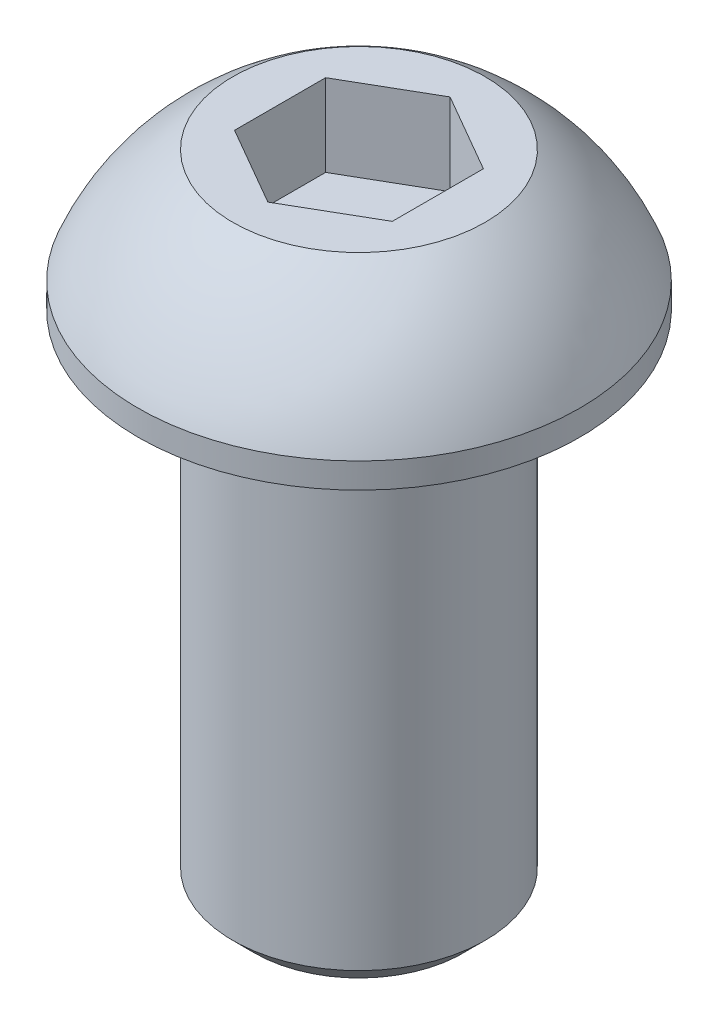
ISO-10303-21;
HEADER;
FILE_DESCRIPTION(('STEP AP214'),'2;1');
FILE_NAME('part.step','',(''),(''),'','','');
FILE_SCHEMA(('AUTOMOTIVE_DESIGN { 1 0 10303 214 1 1 1 1 }'));
ENDSEC;
DATA;
#1=APPLICATION_CONTEXT('core data for automotive mechanical design processes');
#2=APPLICATION_PROTOCOL_DEFINITION('international standard','automotive_design',2000,#1);
#3=PRODUCT_CONTEXT('',#1,'mechanical');
#4=PRODUCT('Part','Part','',(#3));
#5=PRODUCT_RELATED_PRODUCT_CATEGORY('part','',(#4));
#6=PRODUCT_DEFINITION_FORMATION('','',#4);
#7=PRODUCT_DEFINITION_CONTEXT('part definition',#1,'design');
#8=PRODUCT_DEFINITION('design','',#6,#7);
#9=PRODUCT_DEFINITION_SHAPE('','',#8);
#10=(LENGTH_UNIT() NAMED_UNIT(*) SI_UNIT(.MILLI.,.METRE.));
#11=(NAMED_UNIT(*) PLANE_ANGLE_UNIT() SI_UNIT($,.RADIAN.));
#12=(NAMED_UNIT(*) SI_UNIT($,.STERADIAN.) SOLID_ANGLE_UNIT());
#13=UNCERTAINTY_MEASURE_WITH_UNIT(LENGTH_MEASURE(1.E-05),#10,'distance_accuracy_value','');
#14=(GEOMETRIC_REPRESENTATION_CONTEXT(3) GLOBAL_UNCERTAINTY_ASSIGNED_CONTEXT((#13)) GLOBAL_UNIT_ASSIGNED_CONTEXT((#10,
#11,#12)) REPRESENTATION_CONTEXT('',''));
#15=CARTESIAN_POINT('',(0.,0.,0.));
#16=DIRECTION('',(0.,0.,1.));
#17=DIRECTION('',(1.,0.,0.));
#18=AXIS2_PLACEMENT_3D('',#15,#16,#17);
#19=CARTESIAN_POINT('',(0.,0.,0.));
#20=DIRECTION('',(0.,-1.,0.));
#21=DIRECTION('',(0.,0.,-1.));
#22=AXIS2_PLACEMENT_3D('',#19,#20,#21);
#23=PLANE('',#22);
#24=CARTESIAN_POINT('',(0.,0.,0.));
#25=DIRECTION('',(0.,-1.,0.));
#26=DIRECTION('',(0.,0.,-1.));
#27=AXIS2_PLACEMENT_3D('',#24,#25,#26);
#28=CIRCLE('',#27,4.);
#29=CARTESIAN_POINT('',(0.,0.,-4.));
#30=VERTEX_POINT('',#29);
#31=EDGE_CURVE('E131',#30,#30,#28,.T.);
#32=ORIENTED_EDGE('',*,*,#31,.F.);
#33=EDGE_LOOP('',(#32));
#34=FACE_BOUND('',#33,.T.);
#35=CARTESIAN_POINT('',(0.,0.,0.));
#36=DIRECTION('',(0.,-1.,0.));
#37=DIRECTION('',(0.,0.,-1.));
#38=AXIS2_PLACEMENT_3D('',#35,#36,#37);
#39=CIRCLE('',#38,7.);
#40=CARTESIAN_POINT('',(0.,0.,-7.));
#41=VERTEX_POINT('',#40);
#42=EDGE_CURVE('E11',#41,#41,#39,.T.);
#43=ORIENTED_EDGE('',*,*,#42,.T.);
#44=EDGE_LOOP('',(#43));
#45=FACE_BOUND('',#44,.T.);
#46=ADVANCED_FACE('F29',(#34,#45),#23,.T.);
#47=CARTESIAN_POINT('',(0.,0.,0.));
#48=DIRECTION('',(0.,-1.,0.));
#49=DIRECTION('',(0.,0.,-1.));
#50=AXIS2_PLACEMENT_3D('',#47,#48,#49);
#51=CYLINDRICAL_SURFACE('',#50,7.);
#52=CARTESIAN_POINT('',(0.,0.8,0.));
#53=DIRECTION('',(0.,-1.,0.));
#54=DIRECTION('',(0.,0.,-1.));
#55=AXIS2_PLACEMENT_3D('',#52,#53,#54);
#56=CIRCLE('',#55,7.);
#57=CARTESIAN_POINT('',(7.,0.8,0.));
#58=VERTEX_POINT('',#57);
#59=EDGE_CURVE('E36',#58,#58,#56,.T.);
#60=ORIENTED_EDGE('',*,*,#59,.T.);
#61=EDGE_LOOP('',(#60));
#62=FACE_BOUND('',#61,.T.);
#63=ORIENTED_EDGE('',*,*,#42,.F.);
#64=EDGE_LOOP('',(#63));
#65=FACE_BOUND('',#64,.T.);
#66=ADVANCED_FACE('F151',(#62,#65),#51,.T.);
#67=CARTESIAN_POINT('',(0.,-1.98333333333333,0.));
#68=DIRECTION('',(0.,-1.,0.));
#69=DIRECTION('',(1.,0.,0.));
#70=AXIS2_PLACEMENT_3D('',#67,#68,#69);
#71=SPHERICAL_SURFACE('',#70,7.53305677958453);
#72=CARTESIAN_POINT('',(0.,4.4,0.));
#73=DIRECTION('',(0.,-1.,0.));
#74=DIRECTION('',(0.,0.,-1.));
#75=AXIS2_PLACEMENT_3D('',#72,#73,#74);
#76=CIRCLE('',#75,4.);
#77=CARTESIAN_POINT('',(4.,4.4,0.));
#78=VERTEX_POINT('',#77);
#79=EDGE_CURVE('E146',#78,#78,#76,.T.);
#80=CARTESIAN_POINT('',(4.,4.4,0.));
#81=CARTESIAN_POINT('',(4.04206169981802,4.37364288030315,0.));
#82=CARTESIAN_POINT('',(4.08386281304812,4.34686991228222,0.));
#83=CARTESIAN_POINT('',(4.16692769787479,4.2925029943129,0.));
#84=CARTESIAN_POINT('',(4.20819146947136,4.26490904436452,0.));
#85=CARTESIAN_POINT('',(4.29016550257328,4.20891087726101,0.));
#86=CARTESIAN_POINT('',(4.33087576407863,4.18050666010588,0.));
#87=CARTESIAN_POINT('',(4.41172688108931,4.1228990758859,0.));
#88=CARTESIAN_POINT('',(4.45186773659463,4.09369570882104,0.));
#89=CARTESIAN_POINT('',(4.53156435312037,4.03450123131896,0.));
#90=CARTESIAN_POINT('',(4.57112011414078,4.00451012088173,0.));
#91=CARTESIAN_POINT('',(4.64963108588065,3.94375187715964,0.));
#92=CARTESIAN_POINT('',(4.6885862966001,3.91298474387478,0.));
#93=CARTESIAN_POINT('',(4.76588094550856,3.85068647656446,0.));
#94=CARTESIAN_POINT('',(4.80422038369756,3.819155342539,0.));
#95=CARTESIAN_POINT('',(4.88026850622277,3.75534139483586,0.));
#96=CARTESIAN_POINT('',(4.91797719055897,3.72305858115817,0.));
#97=CARTESIAN_POINT('',(4.99274907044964,3.65775388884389,0.));
#98=CARTESIAN_POINT('',(5.02981226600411,3.6247320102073,0.));
#99=CARTESIAN_POINT('',(5.10327868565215,3.55796209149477,0.));
#100=CARTESIAN_POINT('',(5.13968190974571,3.52421405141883,0.));
#101=CARTESIAN_POINT('',(5.21181416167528,3.45600499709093,0.));
#102=CARTESIAN_POINT('',(5.24754318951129,3.42154398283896,0.));
#103=CARTESIAN_POINT('',(5.31831308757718,3.35192244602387,0.));
#104=CARTESIAN_POINT('',(5.35335395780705,3.31676192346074,0.));
#105=CARTESIAN_POINT('',(5.4227338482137,3.24575510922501,0.));
#106=CARTESIAN_POINT('',(5.45707286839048,3.20990881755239,0.));
#107=CARTESIAN_POINT('',(5.52503564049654,3.13754447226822,0.));
#108=CARTESIAN_POINT('',(5.55865939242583,3.10102641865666,0.));
#109=CARTESIAN_POINT('',(5.62517848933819,3.02733281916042,0.));
#110=CARTESIAN_POINT('',(5.65807383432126,2.99015727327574,0.));
#111=CARTESIAN_POINT('',(5.7231232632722,2.91516321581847,0.));
#112=CARTESIAN_POINT('',(5.75527734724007,2.87734470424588,0.));
#113=CARTESIAN_POINT('',(5.81883168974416,2.80107949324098,0.));
#114=CARTESIAN_POINT('',(5.85023194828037,2.76263279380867,0.));
#115=CARTESIAN_POINT('',(5.91226637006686,2.68512623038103,0.));
#116=CARTESIAN_POINT('',(5.94290053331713,2.64606636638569,0.));
#117=CARTESIAN_POINT('',(6.00339079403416,2.56734873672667,0.));
#118=CARTESIAN_POINT('',(6.0332468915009,2.52769097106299,0.));
#119=CARTESIAN_POINT('',(6.09216935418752,2.44779303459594,0.));
#120=CARTESIAN_POINT('',(6.12123571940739,2.40755286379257,0.));
#121=CARTESIAN_POINT('',(6.17856735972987,2.32650584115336,0.));
#122=CARTESIAN_POINT('',(6.20683263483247,2.28569898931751,0.));
#123=CARTESIAN_POINT('',(6.26255105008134,2.2035345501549,0.));
#124=CARTESIAN_POINT('',(6.2900041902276,2.16217696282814,0.));
#125=CARTESIAN_POINT('',(6.34408760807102,2.07892721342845,0.));
#126=CARTESIAN_POINT('',(6.37071788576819,2.03703505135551,0.));
#127=CARTESIAN_POINT('',(6.42314517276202,1.95273252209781,0.));
#128=CARTESIAN_POINT('',(6.44894218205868,1.91032215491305,0.));
#129=CARTESIAN_POINT('',(6.49969285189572,1.82499978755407,0.));
#130=CARTESIAN_POINT('',(6.5246465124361,1.78208778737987,0.));
#131=CARTESIAN_POINT('',(6.57370073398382,1.69577892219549,0.));
#132=CARTESIAN_POINT('',(6.59780129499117,1.65238205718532,0.));
#133=CARTESIAN_POINT('',(6.64513989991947,1.56512041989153,0.));
#134=CARTESIAN_POINT('',(6.66837794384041,1.52125564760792,0.));
#135=CARTESIAN_POINT('',(6.71398243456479,1.43307533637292,0.));
#136=CARTESIAN_POINT('',(6.73634888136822,1.38875979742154,0.));
#137=CARTESIAN_POINT('',(6.78020143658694,1.29969526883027,0.));
#138=CARTESIAN_POINT('',(6.80168754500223,1.25494627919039,0.));
#139=CARTESIAN_POINT('',(6.84377103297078,1.1650323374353,0.));
#140=CARTESIAN_POINT('',(6.86436841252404,1.11986738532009,0.));
#141=CARTESIAN_POINT('',(6.90466637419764,1.02913915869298,0.));
#142=CARTESIAN_POINT('',(6.92436695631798,0.983575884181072,0.));
#143=CARTESIAN_POINT('',(6.96286369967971,0.892068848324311,0.));
#144=CARTESIAN_POINT('',(6.9816598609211,0.846125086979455,0.));
#145=CARTESIAN_POINT('',(7.,0.8,0.));
#146=B_SPLINE_CURVE_WITH_KNOTS('',3,(#80,#81,#82,#83,#84,#85,#86,#87,#88,#89,#90,#91,#92,#93,
#94,#95,#96,#97,#98,#99,#100,#101,#102,#103,#104,#105,#106,#107,#108,#109,#110,#111,#112,#113,
#114,#115,#116,#117,#118,#119,#120,#121,#122,#123,#124,#125,#126,#127,#128,#129,#130,#131,#132,
#133,#134,#135,#136,#137,#138,#139,#140,#141,#142,#143,#144,#145),.UNSPECIFIED.,.F.,.F.,(4,2,2,
2,2,2,2,2,2,2,2,2,2,2,2,2,2,2,2,2,2,2,2,2,2,2,2,2,2,2,2,2,4),(0.,0.148910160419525,
0.29782032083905,0.446730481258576,0.5956406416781,0.744550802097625,0.89346096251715,
1.04237112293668,1.1912812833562,1.34019144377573,1.48910160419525,1.63801176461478,
1.7869219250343,1.93583208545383,2.08474224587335,2.23365240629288,2.3825625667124,
2.53147272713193,2.68038288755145,2.82929304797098,2.9782032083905,3.12711336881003,
3.27602352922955,3.42493368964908,3.5738438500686,3.72275401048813,3.87166417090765,
4.02057433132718,4.1694844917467,4.31839465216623,4.46730481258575,4.61621497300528,
4.7651251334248),.UNSPECIFIED.);
#147=EDGE_CURVE('BSEAM154',#78,#58,#146,.T.);
#148=ORIENTED_EDGE('',*,*,#79,.T.);
#149=ORIENTED_EDGE('',*,*,#59,.F.);
#150=ORIENTED_EDGE('',*,*,#147,.T.);
#151=ORIENTED_EDGE('',*,*,#147,.F.);
#152=EDGE_LOOP('',(#148,#150,#149,#151));
#153=FACE_BOUND('',#152,.T.);
#154=ADVANCED_FACE('F154',(#153),#71,.T.);
#155=CARTESIAN_POINT('',(4.,4.4,0.));
#156=DIRECTION('',(0.,1.,0.));
#157=DIRECTION('',(0.,0.,1.));
#158=AXIS2_PLACEMENT_3D('',#155,#156,#157);
#159=PLANE('',#158);
#160=DIRECTION('',(1.02068756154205E-11,0.,1.));
#161=VECTOR('',#160,1.);
#162=CARTESIAN_POINT('',(-2.50000000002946,4.4,-1.4433756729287));
#163=LINE('',#162,#161);
#164=CARTESIAN_POINT('',(-2.50000000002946,4.4,-1.4433756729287));
#165=VERTEX_POINT('',#164);
#166=CARTESIAN_POINT('',(-2.5,4.4,1.44337567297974));
#167=VERTEX_POINT('',#166);
#168=EDGE_CURVE('E43',#165,#167,#163,.T.);
#169=ORIENTED_EDGE('',*,*,#168,.F.);
#170=DIRECTION('',(-0.866025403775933,0.,0.500000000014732));
#171=VECTOR('',#170,1.);
#172=CARTESIAN_POINT('',(-4.41968441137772E-11,4.4,-2.88675134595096));
#173=LINE('',#172,#171);
#174=CARTESIAN_POINT('',(-4.41968441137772E-11,4.4,-2.88675134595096));
#175=VERTEX_POINT('',#174);
#176=EDGE_CURVE('E113',#175,#165,#173,.T.);
#177=ORIENTED_EDGE('',*,*,#176,.F.);
#178=DIRECTION('',(-0.866025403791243,0.,-0.499999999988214));
#179=VECTOR('',#178,1.);
#180=CARTESIAN_POINT('',(2.49999999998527,4.4,-1.44337567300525));
#181=LINE('',#180,#179);
#182=CARTESIAN_POINT('',(2.49999999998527,4.4,-1.44337567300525));
#183=VERTEX_POINT('',#182);
#184=EDGE_CURVE('E107',#183,#175,#181,.T.);
#185=ORIENTED_EDGE('',*,*,#184,.F.);
#186=DIRECTION('',(-1.02067253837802E-11,0.,-1.));
#187=VECTOR('',#186,1.);
#188=CARTESIAN_POINT('',(2.50000000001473,4.4,1.44337567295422));
#189=LINE('',#188,#187);
#190=CARTESIAN_POINT('',(2.50000000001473,4.4,1.44337567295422));
#191=VERTEX_POINT('',#190);
#192=EDGE_CURVE('E105',#191,#183,#189,.T.);
#193=ORIENTED_EDGE('',*,*,#192,.F.);
#194=DIRECTION('',(0.866025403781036,0.,-0.500000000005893));
#195=VECTOR('',#194,1.);
#196=CARTESIAN_POINT('',(1.47322813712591E-11,4.4,2.88675134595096));
#197=LINE('',#196,#195);
#198=CARTESIAN_POINT('',(1.47322813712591E-11,4.4,2.88675134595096));
#199=VERTEX_POINT('',#198);
#200=EDGE_CURVE('E86',#199,#191,#197,.T.);
#201=ORIENTED_EDGE('',*,*,#200,.F.);
#202=DIRECTION('',(0.86602540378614,0.,0.499999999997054));
#203=VECTOR('',#202,1.);
#204=CARTESIAN_POINT('',(-2.5,4.4,1.44337567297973));
#205=LINE('',#204,#203);
#206=EDGE_CURVE('E97',#167,#199,#205,.T.);
#207=ORIENTED_EDGE('',*,*,#206,.F.);
#208=EDGE_LOOP('',(#169,#177,#185,#193,#201,#207));
#209=FACE_BOUND('',#208,.T.);
#210=ORIENTED_EDGE('',*,*,#79,.F.);
#211=EDGE_LOOP('',(#210));
#212=FACE_BOUND('',#211,.T.);
#213=ADVANCED_FACE('F101',(#209,#212),#159,.T.);
#214=CARTESIAN_POINT('',(0.,-16.,0.));
#215=DIRECTION('',(0.,-1.,0.));
#216=DIRECTION('',(0.,0.,-1.));
#217=AXIS2_PLACEMENT_3D('',#214,#215,#216);
#218=PLANE('',#217);
#219=CARTESIAN_POINT('',(0.,-16.,0.));
#220=DIRECTION('',(0.,-1.,0.));
#221=DIRECTION('',(0.,0.,-1.));
#222=AXIS2_PLACEMENT_3D('',#219,#220,#221);
#223=CIRCLE('',#222,3.3095);
#224=CARTESIAN_POINT('',(0.,-16.,-3.3095));
#225=VERTEX_POINT('',#224);
#226=EDGE_CURVE('E143',#225,#225,#223,.T.);
#227=ORIENTED_EDGE('',*,*,#226,.T.);
#228=EDGE_LOOP('',(#227));
#229=FACE_BOUND('',#228,.T.);
#230=ADVANCED_FACE('F162',(#229),#218,.T.);
#231=CARTESIAN_POINT('',(0.,-16.,0.));
#232=DIRECTION('',(0.,1.,0.));
#233=DIRECTION('',(0.,0.,1.));
#234=AXIS2_PLACEMENT_3D('',#231,#232,#233);
#235=CONICAL_SURFACE('',#234,3.3095,0.785398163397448);
#236=CARTESIAN_POINT('',(0.,-15.3095,0.));
#237=DIRECTION('',(0.,-1.,0.));
#238=DIRECTION('',(0.,0.,-1.));
#239=AXIS2_PLACEMENT_3D('',#236,#237,#238);
#240=CIRCLE('',#239,4.);
#241=CARTESIAN_POINT('',(0.,-15.3095,-4.));
#242=VERTEX_POINT('',#241);
#243=EDGE_CURVE('E140',#242,#242,#240,.T.);
#244=ORIENTED_EDGE('',*,*,#243,.T.);
#245=EDGE_LOOP('',(#244));
#246=FACE_BOUND('',#245,.T.);
#247=ORIENTED_EDGE('',*,*,#226,.F.);
#248=EDGE_LOOP('',(#247));
#249=FACE_BOUND('',#248,.T.);
#250=ADVANCED_FACE('F176',(#246,#249),#235,.T.);
#251=CARTESIAN_POINT('',(0.,0.,0.));
#252=DIRECTION('',(0.,-1.,0.));
#253=DIRECTION('',(0.,0.,-1.));
#254=AXIS2_PLACEMENT_3D('',#251,#252,#253);
#255=CYLINDRICAL_SURFACE('',#254,4.);
#256=ORIENTED_EDGE('',*,*,#31,.T.);
#257=EDGE_LOOP('',(#256));
#258=FACE_BOUND('',#257,.T.);
#259=ORIENTED_EDGE('',*,*,#243,.F.);
#260=EDGE_LOOP('',(#259));
#261=FACE_BOUND('',#260,.T.);
#262=ADVANCED_FACE('F172',(#258,#261),#255,.T.);
#263=CARTESIAN_POINT('',(-2.50000000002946,1.8,-1.4433756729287));
#264=DIRECTION('',(-1.,0.,1.02068756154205E-11));
#265=DIRECTION('',(1.02068756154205E-11,0.,1.));
#266=AXIS2_PLACEMENT_3D('',#263,#264,#265);
#267=PLANE('',#266);
#268=ORIENTED_EDGE('',*,*,#168,.T.);
#269=DIRECTION('',(0.,1.,0.));
#270=VECTOR('',#269,1.);
#271=CARTESIAN_POINT('',(-2.5,1.8,1.44337567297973));
#272=LINE('',#271,#270);
#273=CARTESIAN_POINT('',(-2.5,1.8,1.44337567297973));
#274=VERTEX_POINT('',#273);
#275=EDGE_CURVE('E94',#274,#167,#272,.T.);
#276=ORIENTED_EDGE('',*,*,#275,.F.);
#277=DIRECTION('',(1.02068756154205E-11,0.,1.));
#278=VECTOR('',#277,1.);
#279=CARTESIAN_POINT('',(-2.50000000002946,1.8,-1.4433756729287));
#280=LINE('',#279,#278);
#281=CARTESIAN_POINT('',(-2.50000000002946,1.8,-1.4433756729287));
#282=VERTEX_POINT('',#281);
#283=EDGE_CURVE('E115',#282,#274,#280,.T.);
#284=ORIENTED_EDGE('',*,*,#283,.F.);
#285=DIRECTION('',(0.,1.,0.));
#286=VECTOR('',#285,1.);
#287=CARTESIAN_POINT('',(-2.50000000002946,1.8,-1.4433756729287));
#288=LINE('',#287,#286);
#289=EDGE_CURVE('E50',#282,#165,#288,.T.);
#290=ORIENTED_EDGE('',*,*,#289,.T.);
#291=EDGE_LOOP('',(#268,#276,#284,#290));
#292=FACE_BOUND('',#291,.T.);
#293=ADVANCED_FACE('F175',(#292),#267,.F.);
#294=CARTESIAN_POINT('',(-4.41968441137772E-11,1.8,-2.88675134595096));
#295=DIRECTION('',(-0.500000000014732,0.,-0.866025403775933));
#296=DIRECTION('',(-0.866025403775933,0.,0.500000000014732));
#297=AXIS2_PLACEMENT_3D('',#294,#295,#296);
#298=PLANE('',#297);
#299=ORIENTED_EDGE('',*,*,#176,.T.);
#300=ORIENTED_EDGE('',*,*,#289,.F.);
#301=DIRECTION('',(-0.866025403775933,0.,0.500000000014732));
#302=VECTOR('',#301,1.);
#303=CARTESIAN_POINT('',(-4.41968441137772E-11,1.8,-2.88675134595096));
#304=LINE('',#303,#302);
#305=CARTESIAN_POINT('',(-4.41968441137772E-11,1.8,-2.88675134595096));
#306=VERTEX_POINT('',#305);
#307=EDGE_CURVE('E127',#306,#282,#304,.T.);
#308=ORIENTED_EDGE('',*,*,#307,.F.);
#309=DIRECTION('',(0.,1.,0.));
#310=VECTOR('',#309,1.);
#311=CARTESIAN_POINT('',(-4.41968441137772E-11,1.8,-2.88675134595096));
#312=LINE('',#311,#310);
#313=EDGE_CURVE('E132',#306,#175,#312,.T.);
#314=ORIENTED_EDGE('',*,*,#313,.T.);
#315=EDGE_LOOP('',(#299,#300,#308,#314));
#316=FACE_BOUND('',#315,.T.);
#317=ADVANCED_FACE('F192',(#316),#298,.F.);
#318=CARTESIAN_POINT('',(2.49999999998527,1.8,-1.44337567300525));
#319=DIRECTION('',(0.499999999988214,0.,-0.866025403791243));
#320=DIRECTION('',(-0.866025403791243,0.,-0.499999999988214));
#321=AXIS2_PLACEMENT_3D('',#318,#319,#320);
#322=PLANE('',#321);
#323=ORIENTED_EDGE('',*,*,#184,.T.);
#324=ORIENTED_EDGE('',*,*,#313,.F.);
#325=DIRECTION('',(-0.866025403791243,0.,-0.499999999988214));
#326=VECTOR('',#325,1.);
#327=CARTESIAN_POINT('',(2.49999999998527,1.8,-1.44337567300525));
#328=LINE('',#327,#326);
#329=CARTESIAN_POINT('',(2.49999999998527,1.8,-1.44337567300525));
#330=VERTEX_POINT('',#329);
#331=EDGE_CURVE('E124',#330,#306,#328,.T.);
#332=ORIENTED_EDGE('',*,*,#331,.F.);
#333=DIRECTION('',(0.,1.,0.));
#334=VECTOR('',#333,1.);
#335=CARTESIAN_POINT('',(2.49999999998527,1.8,-1.44337567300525));
#336=LINE('',#335,#334);
#337=EDGE_CURVE('E134',#330,#183,#336,.T.);
#338=ORIENTED_EDGE('',*,*,#337,.T.);
#339=EDGE_LOOP('',(#323,#324,#332,#338));
#340=FACE_BOUND('',#339,.T.);
#341=ADVANCED_FACE('F201',(#340),#322,.F.);
#342=CARTESIAN_POINT('',(2.50000000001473,1.8,1.44337567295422));
#343=DIRECTION('',(1.,0.,-1.02067253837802E-11));
#344=DIRECTION('',(-1.02067253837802E-11,0.,-1.));
#345=AXIS2_PLACEMENT_3D('',#342,#343,#344);
#346=PLANE('',#345);
#347=ORIENTED_EDGE('',*,*,#192,.T.);
#348=ORIENTED_EDGE('',*,*,#337,.F.);
#349=DIRECTION('',(-1.02067253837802E-11,0.,-1.));
#350=VECTOR('',#349,1.);
#351=CARTESIAN_POINT('',(2.50000000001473,1.8,1.44337567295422));
#352=LINE('',#351,#350);
#353=CARTESIAN_POINT('',(2.50000000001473,1.8,1.44337567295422));
#354=VERTEX_POINT('',#353);
#355=EDGE_CURVE('E121',#354,#330,#352,.T.);
#356=ORIENTED_EDGE('',*,*,#355,.F.);
#357=DIRECTION('',(0.,1.,0.));
#358=VECTOR('',#357,1.);
#359=CARTESIAN_POINT('',(2.50000000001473,1.8,1.44337567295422));
#360=LINE('',#359,#358);
#361=EDGE_CURVE('E93',#354,#191,#360,.T.);
#362=ORIENTED_EDGE('',*,*,#361,.T.);
#363=EDGE_LOOP('',(#347,#348,#356,#362));
#364=FACE_BOUND('',#363,.T.);
#365=ADVANCED_FACE('F198',(#364),#346,.F.);
#366=CARTESIAN_POINT('',(1.47322813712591E-11,1.8,2.88675134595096));
#367=DIRECTION('',(0.500000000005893,0.,0.866025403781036));
#368=DIRECTION('',(0.866025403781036,0.,-0.500000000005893));
#369=AXIS2_PLACEMENT_3D('',#366,#367,#368);
#370=PLANE('',#369);
#371=ORIENTED_EDGE('',*,*,#200,.T.);
#372=ORIENTED_EDGE('',*,*,#361,.F.);
#373=DIRECTION('',(0.866025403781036,0.,-0.500000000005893));
#374=VECTOR('',#373,1.);
#375=CARTESIAN_POINT('',(1.47322813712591E-11,1.8,2.88675134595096));
#376=LINE('',#375,#374);
#377=CARTESIAN_POINT('',(1.47322813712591E-11,1.8,2.88675134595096));
#378=VERTEX_POINT('',#377);
#379=EDGE_CURVE('E89',#378,#354,#376,.T.);
#380=ORIENTED_EDGE('',*,*,#379,.F.);
#381=DIRECTION('',(0.,1.,0.));
#382=VECTOR('',#381,1.);
#383=CARTESIAN_POINT('',(1.47322813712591E-11,1.8,2.88675134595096));
#384=LINE('',#383,#382);
#385=EDGE_CURVE('E82',#378,#199,#384,.T.);
#386=ORIENTED_EDGE('',*,*,#385,.T.);
#387=EDGE_LOOP('',(#371,#372,#380,#386));
#388=FACE_BOUND('',#387,.T.);
#389=ADVANCED_FACE('F84',(#388),#370,.F.);
#390=CARTESIAN_POINT('',(-2.5,1.8,1.44337567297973));
#391=DIRECTION('',(-0.499999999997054,0.,0.86602540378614));
#392=DIRECTION('',(0.86602540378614,0.,0.499999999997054));
#393=AXIS2_PLACEMENT_3D('',#390,#391,#392);
#394=PLANE('',#393);
#395=ORIENTED_EDGE('',*,*,#206,.T.);
#396=ORIENTED_EDGE('',*,*,#385,.F.);
#397=DIRECTION('',(0.86602540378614,0.,0.499999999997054));
#398=VECTOR('',#397,1.);
#399=CARTESIAN_POINT('',(-2.5,1.8,1.44337567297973));
#400=LINE('',#399,#398);
#401=EDGE_CURVE('E118',#274,#378,#400,.T.);
#402=ORIENTED_EDGE('',*,*,#401,.F.);
#403=ORIENTED_EDGE('',*,*,#275,.T.);
#404=EDGE_LOOP('',(#395,#396,#402,#403));
#405=FACE_BOUND('',#404,.T.);
#406=ADVANCED_FACE('F98',(#405),#394,.F.);
#407=CARTESIAN_POINT('',(-2.49999999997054,1.8,4.3301270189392));
#408=DIRECTION('',(0.,1.,0.));
#409=DIRECTION('',(0.,0.,1.));
#410=AXIS2_PLACEMENT_3D('',#407,#408,#409);
#411=PLANE('',#410);
#412=ORIENTED_EDGE('',*,*,#283,.T.);
#413=ORIENTED_EDGE('',*,*,#401,.T.);
#414=ORIENTED_EDGE('',*,*,#379,.T.);
#415=ORIENTED_EDGE('',*,*,#355,.T.);
#416=ORIENTED_EDGE('',*,*,#331,.T.);
#417=ORIENTED_EDGE('',*,*,#307,.T.);
#418=EDGE_LOOP('',(#412,#413,#414,#415,#416,#417));
#419=FACE_BOUND('',#418,.T.);
#420=ADVANCED_FACE('F195',(#419),#411,.T.);
#421=CLOSED_SHELL('',(#46,#66,#154,#213,#230,#250,#262,#293,#317,#341,#365,#389,#406,#420));
#422=MANIFOLD_SOLID_BREP('B2',#421);
#423=ADVANCED_BREP_SHAPE_REPRESENTATION('',(#18,#422),#14);
#424=SHAPE_DEFINITION_REPRESENTATION(#9,#423);
ENDSEC;
END-ISO-10303-21;
